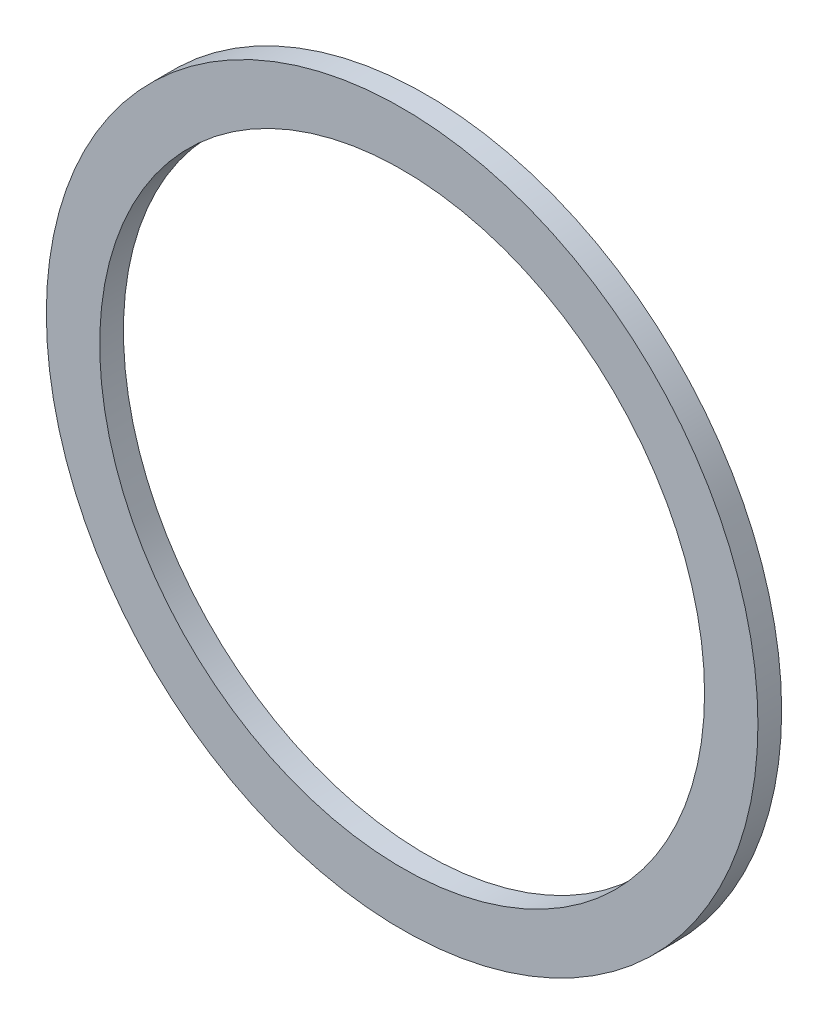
from build123d import *

# Parameters (mm, degrees)
SKIZZE1_R                       = 30
SKIZZE1_R_2                     = 25.5
AUFSATZ_LINEAR_AUSTRAGEN1_DEPTH = 2


with BuildPart() as part:
    # Skizze1 → Aufsatz-Linear austragen1 (new body)
    with BuildSketch(Plane.XY):
        Circle(SKIZZE1_R)
        Circle(SKIZZE1_R_2, mode=Mode.SUBTRACT)
    extrude(amount=AUFSATZ_LINEAR_AUSTRAGEN1_DEPTH)


solid = part.part
